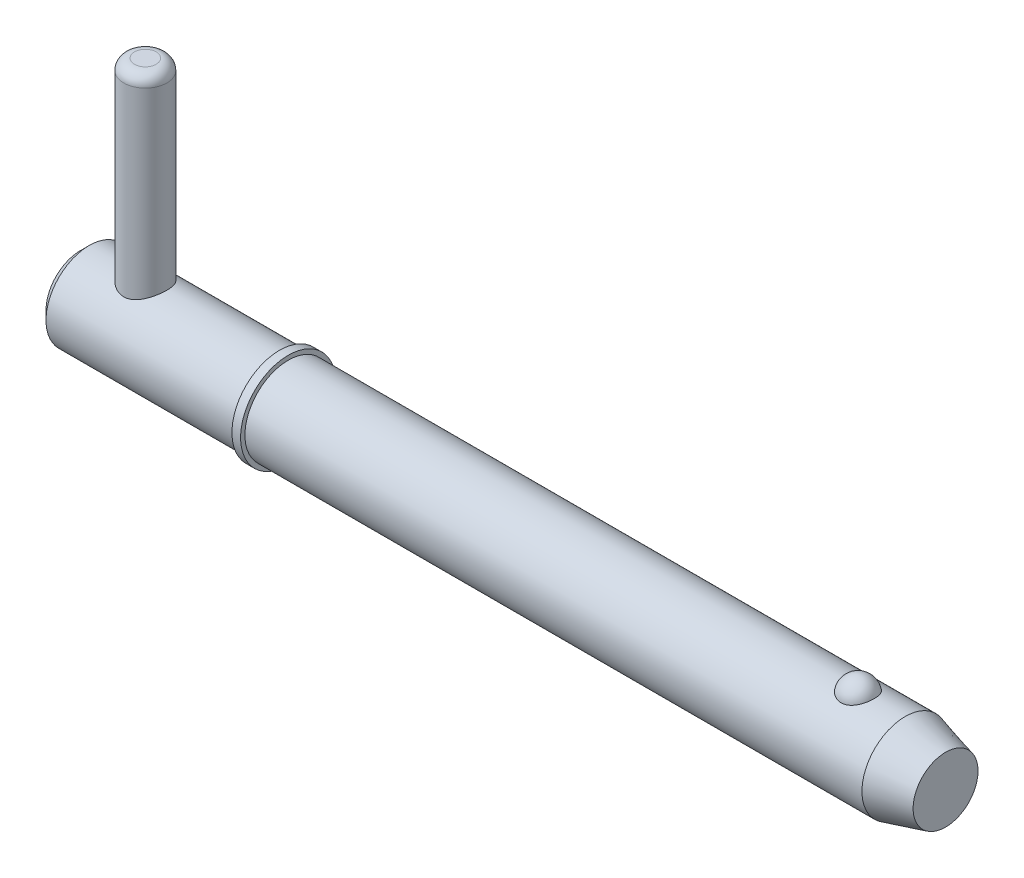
ISO-10303-21;
HEADER;
FILE_DESCRIPTION(('STEP AP214'),'2;1');
FILE_NAME('part.step','',(''),(''),'','','');
FILE_SCHEMA(('AUTOMOTIVE_DESIGN { 1 0 10303 214 1 1 1 1 }'));
ENDSEC;
DATA;
#1=APPLICATION_CONTEXT('core data for automotive mechanical design processes');
#2=APPLICATION_PROTOCOL_DEFINITION('international standard','automotive_design',2000,#1);
#3=PRODUCT_CONTEXT('',#1,'mechanical');
#4=PRODUCT('Part','Part','',(#3));
#5=PRODUCT_RELATED_PRODUCT_CATEGORY('part','',(#4));
#6=PRODUCT_DEFINITION_FORMATION('','',#4);
#7=PRODUCT_DEFINITION_CONTEXT('part definition',#1,'design');
#8=PRODUCT_DEFINITION('design','',#6,#7);
#9=PRODUCT_DEFINITION_SHAPE('','',#8);
#10=(LENGTH_UNIT() NAMED_UNIT(*) SI_UNIT(.MILLI.,.METRE.));
#11=(NAMED_UNIT(*) PLANE_ANGLE_UNIT() SI_UNIT($,.RADIAN.));
#12=(NAMED_UNIT(*) SI_UNIT($,.STERADIAN.) SOLID_ANGLE_UNIT());
#13=UNCERTAINTY_MEASURE_WITH_UNIT(LENGTH_MEASURE(1.E-05),#10,'distance_accuracy_value','');
#14=(GEOMETRIC_REPRESENTATION_CONTEXT(3) GLOBAL_UNCERTAINTY_ASSIGNED_CONTEXT((#13)) GLOBAL_UNIT_ASSIGNED_CONTEXT((#10,
#11,#12)) REPRESENTATION_CONTEXT('',''));
#15=CARTESIAN_POINT('',(0.,0.,0.));
#16=DIRECTION('',(0.,0.,1.));
#17=DIRECTION('',(1.,0.,0.));
#18=AXIS2_PLACEMENT_3D('',#15,#16,#17);
#19=CARTESIAN_POINT('',(5.94,21.43,0.));
#20=DIRECTION('',(0.,-1.,0.));
#21=DIRECTION('',(0.,0.,-1.));
#22=AXIS2_PLACEMENT_3D('',#19,#20,#21);
#23=CYLINDRICAL_SURFACE('',#22,1.98);
#24=CARTESIAN_POINT('',(5.94,-2.98,0.));
#25=DIRECTION('',(0.,1.,0.));
#26=DIRECTION('',(0.,0.,1.));
#27=AXIS2_PLACEMENT_3D('',#24,#25,#26);
#28=CIRCLE('',#27,1.98);
#29=CARTESIAN_POINT('',(5.94,-2.98,1.98));
#30=VERTEX_POINT('',#29);
#31=EDGE_CURVE('P0_E25',#30,#30,#28,.T.);
#32=ORIENTED_EDGE('',*,*,#31,.T.);
#33=EDGE_LOOP('',(#32));
#34=FACE_BOUND('',#33,.T.);
#35=CARTESIAN_POINT('',(5.94,20.44,0.));
#36=DIRECTION('',(0.,1.,0.));
#37=DIRECTION('',(0.,0.,1.));
#38=AXIS2_PLACEMENT_3D('',#35,#36,#37);
#39=CIRCLE('',#38,1.98);
#40=CARTESIAN_POINT('',(5.94,20.44,1.98));
#41=VERTEX_POINT('',#40);
#42=EDGE_CURVE('P0_E29',#41,#41,#39,.F.);
#43=ORIENTED_EDGE('',*,*,#42,.T.);
#44=EDGE_LOOP('',(#43));
#45=FACE_BOUND('',#44,.T.);
#46=ADVANCED_FACE('P0_F14',(#34,#45),#23,.T.);
#47=CARTESIAN_POINT('',(5.94,21.43,0.));
#48=DIRECTION('',(0.,1.,0.));
#49=DIRECTION('',(0.,0.,1.));
#50=AXIS2_PLACEMENT_3D('',#47,#48,#49);
#51=PLANE('',#50);
#52=CARTESIAN_POINT('',(5.94,21.43,0.));
#53=DIRECTION('',(0.,1.,0.));
#54=DIRECTION('',(0.,0.,1.));
#55=AXIS2_PLACEMENT_3D('',#52,#53,#54);
#56=CIRCLE('',#55,0.99);
#57=CARTESIAN_POINT('',(5.94,21.43,0.99));
#58=VERTEX_POINT('',#57);
#59=EDGE_CURVE('P0_E10',#58,#58,#56,.T.);
#60=ORIENTED_EDGE('',*,*,#59,.T.);
#61=EDGE_LOOP('',(#60));
#62=FACE_BOUND('',#61,.T.);
#63=ADVANCED_FACE('P0_F46',(#62),#51,.T.);
#64=CARTESIAN_POINT('',(5.94,-3.97,0.));
#65=DIRECTION('',(0.,1.,0.));
#66=DIRECTION('',(0.,0.,1.));
#67=AXIS2_PLACEMENT_3D('',#64,#65,#66);
#68=PLANE('',#67);
#69=CARTESIAN_POINT('',(5.94,-3.97,0.));
#70=DIRECTION('',(0.,1.,0.));
#71=DIRECTION('',(0.,0.,1.));
#72=AXIS2_PLACEMENT_3D('',#69,#70,#71);
#73=CIRCLE('',#72,0.99);
#74=CARTESIAN_POINT('',(5.94,-3.97,0.99));
#75=VERTEX_POINT('',#74);
#76=EDGE_CURVE('P0_E21',#75,#75,#73,.F.);
#77=ORIENTED_EDGE('',*,*,#76,.T.);
#78=EDGE_LOOP('',(#77));
#79=FACE_BOUND('',#78,.T.);
#80=ADVANCED_FACE('P0_F43',(#79),#68,.F.);
#81=CARTESIAN_POINT('',(5.94,-2.98,0.));
#82=DIRECTION('',(0.,1.,0.));
#83=DIRECTION('',(0.,0.,1.));
#84=AXIS2_PLACEMENT_3D('',#81,#82,#83);
#85=DEGENERATE_TOROIDAL_SURFACE('',#84,0.99,0.99,.T.);
#86=ORIENTED_EDGE('',*,*,#76,.F.);
#87=EDGE_LOOP('',(#86));
#88=FACE_BOUND('',#87,.T.);
#89=ORIENTED_EDGE('',*,*,#31,.F.);
#90=EDGE_LOOP('',(#89));
#91=FACE_BOUND('',#90,.T.);
#92=ADVANCED_FACE('P0_F38',(#88,#91),#85,.T.);
#93=CARTESIAN_POINT('',(5.94,20.44,0.));
#94=DIRECTION('',(0.,1.,0.));
#95=DIRECTION('',(0.,0.,1.));
#96=AXIS2_PLACEMENT_3D('',#93,#94,#95);
#97=DEGENERATE_TOROIDAL_SURFACE('',#96,0.99,0.99,.T.);
#98=ORIENTED_EDGE('',*,*,#42,.F.);
#99=EDGE_LOOP('',(#98));
#100=FACE_BOUND('',#99,.T.);
#101=ORIENTED_EDGE('',*,*,#59,.F.);
#102=EDGE_LOOP('',(#101));
#103=FACE_BOUND('',#102,.T.);
#104=ADVANCED_FACE('P0_F16',(#100,#103),#97,.T.);
#105=CLOSED_SHELL('',(#46,#63,#80,#92,#104));
#106=MANIFOLD_SOLID_BREP('P0_B1',#105);
#107=CARTESIAN_POINT('',(0.,0.,0.));
#108=DIRECTION('',(1.,0.,0.));
#109=DIRECTION('',(0.,0.,-1.));
#110=AXIS2_PLACEMENT_3D('',#107,#108,#109);
#111=CYLINDRICAL_SURFACE('',#110,3.97);
#112=CARTESIAN_POINT('',(75.6759395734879,0.,0.));
#113=DIRECTION('',(1.,0.,0.));
#114=DIRECTION('',(0.,0.,-1.));
#115=AXIS2_PLACEMENT_3D('',#112,#113,#114);
#116=CIRCLE('',#115,3.97);
#117=CARTESIAN_POINT('',(75.6759395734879,0.,-3.97));
#118=VERTEX_POINT('',#117);
#119=EDGE_CURVE('P1_E81',#118,#118,#116,.T.);
#120=ORIENTED_EDGE('',*,*,#119,.F.);
#121=EDGE_LOOP('',(#120));
#122=FACE_BOUND('',#121,.T.);
#123=CARTESIAN_POINT('',(19.05,0.,0.));
#124=DIRECTION('',(1.,0.,0.));
#125=DIRECTION('',(0.,0.,-1.));
#126=AXIS2_PLACEMENT_3D('',#123,#124,#125);
#127=CIRCLE('',#126,3.97);
#128=CARTESIAN_POINT('',(19.05,0.,-3.97));
#129=VERTEX_POINT('',#128);
#130=EDGE_CURVE('P1_E85',#129,#129,#127,.T.);
#131=ORIENTED_EDGE('',*,*,#130,.T.);
#132=EDGE_LOOP('',(#131));
#133=FACE_BOUND('',#132,.T.);
#134=CARTESIAN_POINT('',(71.3451922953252,3.65715365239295,1.54470941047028));
#135=CARTESIAN_POINT('',(71.2652448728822,3.65716001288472,1.54470290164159));
#136=CARTESIAN_POINT('',(71.1851650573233,3.65987074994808,1.53832549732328));
#137=CARTESIAN_POINT('',(71.0272374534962,3.6704221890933,1.51297018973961));
#138=CARTESIAN_POINT('',(70.9493961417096,3.67827646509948,1.49395894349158));
#139=CARTESIAN_POINT('',(70.7984614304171,3.69818848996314,1.44395950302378));
#140=CARTESIAN_POINT('',(70.7253560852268,3.71023513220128,1.41300293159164));
#141=CARTESIAN_POINT('',(70.5855630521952,3.7372183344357,1.34000212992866));
#142=CARTESIAN_POINT('',(70.5188725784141,3.75215363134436,1.29796274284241));
#143=CARTESIAN_POINT('',(70.3914886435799,3.78384968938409,1.20248834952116));
#144=CARTESIAN_POINT('',(70.3310299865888,3.80065129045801,1.14875388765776));
#145=CARTESIAN_POINT('',(70.2196942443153,3.83398532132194,1.03205417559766));
#146=CARTESIAN_POINT('',(70.1688200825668,3.85051766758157,0.969086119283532));
#147=CARTESIAN_POINT('',(70.0756321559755,3.88238608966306,0.832526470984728));
#148=CARTESIAN_POINT('',(70.0337961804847,3.89763698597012,0.75858832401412));
#149=CARTESIAN_POINT('',(69.9625108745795,3.92451063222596,0.60435211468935));
#150=CARTESIAN_POINT('',(69.9330623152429,3.93613315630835,0.524053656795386));
#151=CARTESIAN_POINT('',(69.8868927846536,3.95467606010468,0.358403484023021));
#152=CARTESIAN_POINT('',(69.8703127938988,3.96154426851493,0.273006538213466));
#153=CARTESIAN_POINT('',(69.850756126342,3.96967008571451,0.100408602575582));
#154=CARTESIAN_POINT('',(69.8477789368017,3.97092790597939,0.0132076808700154));
#155=CARTESIAN_POINT('',(69.8554587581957,3.96771794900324,-0.159844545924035));
#156=CARTESIAN_POINT('',(69.8660164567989,3.96329187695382,-0.245701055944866));
#157=CARTESIAN_POINT('',(69.9003800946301,3.94923163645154,-0.414277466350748));
#158=CARTESIAN_POINT('',(69.9241862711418,3.93959737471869,-0.496997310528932));
#159=CARTESIAN_POINT('',(69.9846114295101,3.91607752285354,-0.657113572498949));
#160=CARTESIAN_POINT('',(70.0212495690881,3.90218558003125,-0.734501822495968));
#161=CARTESIAN_POINT('',(70.1065935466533,3.87158287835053,-0.88170483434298));
#162=CARTESIAN_POINT('',(70.1553004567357,3.8548718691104,-0.951518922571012));
#163=CARTESIAN_POINT('',(70.2641161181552,3.82028735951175,-1.08208159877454));
#164=CARTESIAN_POINT('',(70.3242955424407,3.80240713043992,-1.14276958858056));
#165=CARTESIAN_POINT('',(70.454493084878,3.76758161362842,-1.2528243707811));
#166=CARTESIAN_POINT('',(70.5245105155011,3.75063626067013,-1.30219195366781));
#167=CARTESIAN_POINT('',(70.67118160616,3.71998948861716,-1.38729709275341));
#168=CARTESIAN_POINT('',(70.7476813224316,3.70623183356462,-1.42327904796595));
#169=CARTESIAN_POINT('',(70.9062981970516,3.68323188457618,-1.48178996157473));
#170=CARTESIAN_POINT('',(70.9884132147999,3.67398788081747,-1.5043240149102));
#171=CARTESIAN_POINT('',(71.1514810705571,3.6615216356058,-1.53440939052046));
#172=CARTESIAN_POINT('',(71.2322840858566,3.65801951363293,-1.54265826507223));
#173=CARTESIAN_POINT('',(71.3942085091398,3.65657341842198,-1.5460842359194));
#174=CARTESIAN_POINT('',(71.4753298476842,3.65862829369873,-1.54126404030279));
#175=CARTESIAN_POINT('',(71.6328122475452,3.66788969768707,-1.51908474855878));
#176=CARTESIAN_POINT('',(71.7092422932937,3.67492621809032,-1.50213925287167));
#177=CARTESIAN_POINT('',(71.8580412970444,3.69318404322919,-1.45666982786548));
#178=CARTESIAN_POINT('',(71.9304099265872,3.70440568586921,-1.42814496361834));
#179=CARTESIAN_POINT('',(72.0708029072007,3.73012749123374,-1.35956319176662));
#180=CARTESIAN_POINT('',(72.1387000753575,3.74469307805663,-1.31927107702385));
#181=CARTESIAN_POINT('',(72.2668649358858,3.77545272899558,-1.22847440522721));
#182=CARTESIAN_POINT('',(72.3271308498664,3.79164717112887,-1.17796747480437));
#183=CARTESIAN_POINT('',(72.4416346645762,3.82490325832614,-1.06519260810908));
#184=CARTESIAN_POINT('',(72.4954137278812,3.84196735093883,-1.00245914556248));
#185=CARTESIAN_POINT('',(72.5920988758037,3.87439863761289,-0.868715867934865));
#186=CARTESIAN_POINT('',(72.6350030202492,3.88976552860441,-0.797704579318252));
#187=CARTESIAN_POINT('',(72.710266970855,3.91771381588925,-0.646896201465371));
#188=CARTESIAN_POINT('',(72.7422532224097,3.93019255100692,-0.566893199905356));
#189=CARTESIAN_POINT('',(72.7931101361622,3.95043886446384,-0.402255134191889));
#190=CARTESIAN_POINT('',(72.8119807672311,3.95820643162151,-0.31762005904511));
#191=CARTESIAN_POINT('',(72.8362162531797,3.96823733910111,-0.146156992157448));
#192=CARTESIAN_POINT('',(72.8415874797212,3.97050327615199,-0.0593300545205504));
#193=CARTESIAN_POINT('',(72.8387309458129,3.96930811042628,0.114057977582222));
#194=CARTESIAN_POINT('',(72.830503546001,3.9658471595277,0.200619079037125));
#195=CARTESIAN_POINT('',(72.8007063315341,3.95358562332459,0.370506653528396));
#196=CARTESIAN_POINT('',(72.7792129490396,3.94481563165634,0.453848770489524));
#197=CARTESIAN_POINT('',(72.7233839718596,3.92284586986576,0.615497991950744));
#198=CARTESIAN_POINT('',(72.6890474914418,3.90964579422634,0.69380474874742));
#199=CARTESIAN_POINT('',(72.6079702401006,3.88006987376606,0.843703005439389));
#200=CARTESIAN_POINT('',(72.5611536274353,3.86367478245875,0.915249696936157));
#201=CARTESIAN_POINT('',(72.4561897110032,3.82949741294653,1.04910810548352));
#202=CARTESIAN_POINT('',(72.3980428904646,3.81171519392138,1.11142021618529));
#203=CARTESIAN_POINT('',(72.2717433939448,3.77673366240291,1.22503948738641));
#204=CARTESIAN_POINT('',(72.2035970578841,3.75953398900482,1.27635357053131));
#205=CARTESIAN_POINT('',(72.0589009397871,3.72770506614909,1.36653336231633));
#206=CARTESIAN_POINT('',(71.982348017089,3.71307678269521,1.40539439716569));
#207=CARTESIAN_POINT('',(71.8257594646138,3.68864287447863,1.46830480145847));
#208=CARTESIAN_POINT('',(71.7459307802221,3.67869017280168,1.49281289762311));
#209=CARTESIAN_POINT('',(71.5829877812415,3.66414535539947,1.52817474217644));
#210=CARTESIAN_POINT('',(71.4998840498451,3.65953723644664,1.53906926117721));
#211=CARTESIAN_POINT('',(71.3927760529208,3.6573894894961,1.54414878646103));
#212=CARTESIAN_POINT('',(71.3689900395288,3.65715175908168,1.54471134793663));
#213=CARTESIAN_POINT('',(71.3451922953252,3.65715365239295,1.54470941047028));
#214=B_SPLINE_CURVE_WITH_KNOTS('',3,(#134,#135,#136,#137,#138,#139,#140,#141,#142,#143,#144,
#145,#146,#147,#148,#149,#150,#151,#152,#153,#154,#155,#156,#157,#158,#159,#160,#161,#162,#163,
#164,#165,#166,#167,#168,#169,#170,#171,#172,#173,#174,#175,#176,#177,#178,#179,#180,#181,#182,
#183,#184,#185,#186,#187,#188,#189,#190,#191,#192,#193,#194,#195,#196,#197,#198,#199,#200,#201,
#202,#203,#204,#205,#206,#207,#208,#209,#210,#211,#212,#213),.UNSPECIFIED.,.T.,.F.,(4,2,2,2,2,2,
2,2,2,2,2,2,2,2,2,2,2,2,2,2,2,2,2,2,2,2,2,2,2,2,2,2,2,2,2,2,2,2,2,4),(0.,0.239777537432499,
0.480190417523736,0.719971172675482,0.959647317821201,1.20639040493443,1.45320863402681,
1.7109367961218,1.96868099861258,2.22921052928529,2.48973023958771,2.74834928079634,
3.00697295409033,3.26598440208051,3.52501886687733,3.78570385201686,4.04637062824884,
4.30201257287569,4.5575576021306,4.80022994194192,5.04285200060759,5.27757006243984,
5.51230707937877,5.75210128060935,5.99195126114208,6.24392810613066,6.49594987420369,
6.75588818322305,7.01582710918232,7.27564332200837,7.53545264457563,7.79377886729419,
8.0521229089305,8.31207418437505,8.57201437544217,8.83179046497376,9.09166393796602,
9.34270057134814,9.59298357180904,9.66435753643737),.UNSPECIFIED.);
#215=CARTESIAN_POINT('',(71.3451922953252,3.65715365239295,1.54470941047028));
#216=VERTEX_POINT('',#215);
#217=EDGE_CURVE('P1_E35',#216,#216,#214,.T.);
#218=ORIENTED_EDGE('',*,*,#217,.T.);
#219=EDGE_LOOP('',(#218));
#220=FACE_BOUND('',#219,.T.);
#221=ADVANCED_FACE('P1_F13',(#122,#133,#220),#111,.T.);
#222=CARTESIAN_POINT('',(0.,0.,0.));
#223=DIRECTION('',(-1.,0.,0.));
#224=DIRECTION('',(0.,0.,1.));
#225=AXIS2_PLACEMENT_3D('',#222,#223,#224);
#226=PLANE('',#225);
#227=CARTESIAN_POINT('',(0.,0.,0.));
#228=DIRECTION('',(1.,0.,0.));
#229=DIRECTION('',(0.,0.,-1.));
#230=AXIS2_PLACEMENT_3D('',#227,#228,#229);
#231=CIRCLE('',#230,3.176);
#232=CARTESIAN_POINT('',(0.,0.,-3.176));
#233=VERTEX_POINT('',#232);
#234=EDGE_CURVE('P1_E9',#233,#233,#231,.T.);
#235=ORIENTED_EDGE('',*,*,#234,.F.);
#236=EDGE_LOOP('',(#235));
#237=FACE_BOUND('',#236,.T.);
#238=ADVANCED_FACE('P1_F15',(#237),#226,.T.);
#239=CARTESIAN_POINT('',(0.793999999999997,0.,0.));
#240=DIRECTION('',(1.,0.,0.));
#241=DIRECTION('',(0.,0.,-1.));
#242=AXIS2_PLACEMENT_3D('',#239,#240,#241);
#243=CONICAL_SURFACE('',#242,3.97,0.78539816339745);
#244=ORIENTED_EDGE('',*,*,#234,.T.);
#245=EDGE_LOOP('',(#244));
#246=FACE_BOUND('',#245,.T.);
#247=CARTESIAN_POINT('',(0.793999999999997,0.,0.));
#248=DIRECTION('',(1.,0.,0.));
#249=DIRECTION('',(0.,0.,-1.));
#250=AXIS2_PLACEMENT_3D('',#247,#248,#249);
#251=CIRCLE('',#250,3.97);
#252=CARTESIAN_POINT('',(0.793999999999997,0.,-3.97));
#253=VERTEX_POINT('',#252);
#254=EDGE_CURVE('P1_E26',#253,#253,#251,.T.);
#255=ORIENTED_EDGE('',*,*,#254,.F.);
#256=EDGE_LOOP('',(#255));
#257=FACE_BOUND('',#256,.T.);
#258=ADVANCED_FACE('P1_F77',(#246,#257),#243,.T.);
#259=CARTESIAN_POINT('',(0.,0.,0.));
#260=DIRECTION('',(1.,0.,0.));
#261=DIRECTION('',(0.,0.,-1.));
#262=AXIS2_PLACEMENT_3D('',#259,#260,#261);
#263=CYLINDRICAL_SURFACE('',#262,3.97);
#264=CARTESIAN_POINT('',(5.94,-3.44100276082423,1.98));
#265=CARTESIAN_POINT('',(5.8367885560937,-3.44101282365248,1.97999171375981));
#266=CARTESIAN_POINT('',(5.73344176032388,-3.44571749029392,1.97187534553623));
#267=CARTESIAN_POINT('',(5.52991905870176,-3.46385873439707,1.93981946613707));
#268=CARTESIAN_POINT('',(5.42975031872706,-3.47731375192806,1.91584653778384));
#269=CARTESIAN_POINT('',(5.23590869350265,-3.51100678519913,1.85336773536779));
#270=CARTESIAN_POINT('',(5.14220446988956,-3.53120882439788,1.81493880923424));
#271=CARTESIAN_POINT('',(4.9625969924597,-3.57606420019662,1.72487335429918));
#272=CARTESIAN_POINT('',(4.87669412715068,-3.6007177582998,1.67323616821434));
#273=CARTESIAN_POINT('',(4.70734412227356,-3.65417020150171,1.55325205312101));
#274=CARTESIAN_POINT('',(4.62467662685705,-3.68314323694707,1.4838818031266));
#275=CARTESIAN_POINT('',(4.47154355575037,-3.74056406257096,1.33252902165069));
#276=CARTESIAN_POINT('',(4.40108404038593,-3.76901158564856,1.25054026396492));
#277=CARTESIAN_POINT('',(4.26974803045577,-3.82445556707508,1.06956584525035));
#278=CARTESIAN_POINT('',(4.20982960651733,-3.8512271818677,0.969809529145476));
#279=CARTESIAN_POINT('',(4.10798077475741,-3.89804342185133,0.760047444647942));
#280=CARTESIAN_POINT('',(4.06603907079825,-3.91809226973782,0.650048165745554));
#281=CARTESIAN_POINT('',(4.00441878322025,-3.94794912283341,0.431181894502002));
#282=CARTESIAN_POINT('',(3.98337329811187,-3.95838209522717,0.322786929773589));
#283=CARTESIAN_POINT('',(3.9596425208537,-3.97016407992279,0.103541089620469));
#284=CARTESIAN_POINT('',(3.95694618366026,-3.97151855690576,-0.00730826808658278));
#285=CARTESIAN_POINT('',(3.9694599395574,-3.96528826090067,-0.218044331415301));
#286=CARTESIAN_POINT('',(3.98314071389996,-3.95846689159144,-0.318049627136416));
#287=CARTESIAN_POINT('',(4.02528522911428,-3.93780347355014,-0.514124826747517));
#288=CARTESIAN_POINT('',(4.05375007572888,-3.92396089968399,-0.61019443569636));
#289=CARTESIAN_POINT('',(4.12484256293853,-3.89028355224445,-0.797351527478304));
#290=CARTESIAN_POINT('',(4.16766142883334,-3.87036821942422,-0.888351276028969));
#291=CARTESIAN_POINT('',(4.26598377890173,-3.82634285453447,-1.06209448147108));
#292=CARTESIAN_POINT('',(4.32149181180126,-3.8022313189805,-1.14483496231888));
#293=CARTESIAN_POINT('',(4.44962332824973,-3.74940011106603,-1.30802500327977));
#294=CARTESIAN_POINT('',(4.52336636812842,-3.72046031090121,-1.38752498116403));
#295=CARTESIAN_POINT('',(4.68287656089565,-3.66269463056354,-1.53354043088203));
#296=CARTESIAN_POINT('',(4.7686527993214,-3.63386885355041,-1.60004599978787));
#297=CARTESIAN_POINT('',(4.9564069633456,-3.57763161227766,-1.72228426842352));
#298=CARTESIAN_POINT('',(5.05906485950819,-3.5504233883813,-1.77707534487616));
#299=CARTESIAN_POINT('',(5.27381412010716,-3.50334038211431,-1.86819784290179));
#300=CARTESIAN_POINT('',(5.38589553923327,-3.48345798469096,-1.90454844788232));
#301=CARTESIAN_POINT('',(5.6069795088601,-3.45548331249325,-1.95481643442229));
#302=CARTESIAN_POINT('',(5.71552407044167,-3.44658268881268,-1.97028113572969));
#303=CARTESIAN_POINT('',(5.93399639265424,-3.43928114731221,-1.98300600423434));
#304=CARTESIAN_POINT('',(6.04392313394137,-3.44087289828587,-1.98027888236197));
#305=CARTESIAN_POINT('',(6.24931618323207,-3.45351901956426,-1.95811780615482));
#306=CARTESIAN_POINT('',(6.34505668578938,-3.46352725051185,-1.94052989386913));
#307=CARTESIAN_POINT('',(6.53204702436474,-3.49033612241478,-1.89188242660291));
#308=CARTESIAN_POINT('',(6.62329540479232,-3.50713894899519,-1.86081853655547));
#309=CARTESIAN_POINT('',(6.80352105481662,-3.54655680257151,-1.78458666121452));
#310=CARTESIAN_POINT('',(6.89219712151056,-3.56940508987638,-1.73883178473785));
#311=CARTESIAN_POINT('',(7.06112449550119,-3.61813012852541,-1.63502913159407));
#312=CARTESIAN_POINT('',(7.14137144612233,-3.6440084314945,-1.57697504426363));
#313=CARTESIAN_POINT('',(7.30168083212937,-3.69977514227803,-1.44171920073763));
#314=CARTESIAN_POINT('',(7.38046039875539,-3.7297597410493,-1.36302972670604));
#315=CARTESIAN_POINT('',(7.52409649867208,-3.78754991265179,-1.19307190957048));
#316=CARTESIAN_POINT('',(7.58894840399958,-3.81535475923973,-1.10179940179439));
#317=CARTESIAN_POINT('',(7.70430122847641,-3.86658972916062,-0.906019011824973));
#318=CARTESIAN_POINT('',(7.75438714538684,-3.88988795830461,-0.801229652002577));
#319=CARTESIAN_POINT('',(7.83572184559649,-3.92848199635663,-0.583216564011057));
#320=CARTESIAN_POINT('',(7.86698708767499,-3.94378479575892,-0.470000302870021));
#321=CARTESIAN_POINT('',(7.90711051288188,-3.96355307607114,-0.249525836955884));
#322=CARTESIAN_POINT('',(7.91775648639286,-3.96888171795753,-0.142669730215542));
#323=CARTESIAN_POINT('',(7.92160247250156,-3.97079858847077,0.0714191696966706));
#324=CARTESIAN_POINT('',(7.91480852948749,-3.96738984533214,0.178651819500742));
#325=CARTESIAN_POINT('',(7.88515479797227,-3.9527181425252,0.383072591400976));
#326=CARTESIAN_POINT('',(7.8633739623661,-3.94198303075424,0.480459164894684));
#327=CARTESIAN_POINT('',(7.80581513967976,-3.91422178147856,0.670038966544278));
#328=CARTESIAN_POINT('',(7.77003513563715,-3.89719473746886,0.762231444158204));
#329=CARTESIAN_POINT('',(7.68389191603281,-3.85747818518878,0.943248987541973));
#330=CARTESIAN_POINT('',(7.63296879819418,-3.83457704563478,1.03175978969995));
#331=CARTESIAN_POINT('',(7.51869140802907,-3.7855122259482,1.19934744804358));
#332=CARTESIAN_POINT('',(7.45533142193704,-3.75934704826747,1.2784199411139));
#333=CARTESIAN_POINT('',(7.31068939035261,-3.70329841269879,1.433144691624));
#334=CARTESIAN_POINT('',(7.22825362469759,-3.67330340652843,1.50768183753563));
#335=CARTESIAN_POINT('',(7.05162367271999,-3.61514025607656,1.64226879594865));
#336=CARTESIAN_POINT('',(6.95741928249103,-3.58697372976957,1.70230590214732));
#337=CARTESIAN_POINT('',(6.75590859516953,-3.53504049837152,1.80775364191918));
#338=CARTESIAN_POINT('',(6.64828786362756,-3.51143624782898,1.85265616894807));
#339=CARTESIAN_POINT('',(6.48137774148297,-3.48289659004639,1.90544537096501));
#340=CARTESIAN_POINT('',(6.42488151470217,-3.4745323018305,1.9206071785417));
#341=CARTESIAN_POINT('',(6.31046920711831,-3.4604244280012,1.94591259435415));
#342=CARTESIAN_POINT('',(6.25255415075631,-3.45467900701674,1.95605971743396));
#343=CARTESIAN_POINT('',(6.1521444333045,-3.44728060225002,1.96905939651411));
#344=CARTESIAN_POINT('',(6.10985721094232,-3.44493297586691,1.97315742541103));
#345=CARTESIAN_POINT('',(6.02505433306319,-3.44179192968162,1.97862952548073));
#346=CARTESIAN_POINT('',(5.98253866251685,-3.44099861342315,1.98000341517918));
#347=CARTESIAN_POINT('',(5.94,-3.44100276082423,1.98));
#348=B_SPLINE_CURVE_WITH_KNOTS('',3,(#264,#265,#266,#267,#268,#269,#270,#271,#272,#273,#274,
#275,#276,#277,#278,#279,#280,#281,#282,#283,#284,#285,#286,#287,#288,#289,#290,#291,#292,#293,
#294,#295,#296,#297,#298,#299,#300,#301,#302,#303,#304,#305,#306,#307,#308,#309,#310,#311,#312,
#313,#314,#315,#316,#317,#318,#319,#320,#321,#322,#323,#324,#325,#326,#327,#328,#329,#330,#331,
#332,#333,#334,#335,#336,#337,#338,#339,#340,#341,#342,#343,#344,#345,#346,#347),.UNSPECIFIED.,
.T.,.F.,(4,2,2,2,2,2,2,2,2,2,2,2,2,2,2,2,2,2,2,2,2,2,2,2,2,2,2,2,2,2,2,2,2,2,2,2,2,2,2,2,2,4),
(0.,0.309462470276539,0.619579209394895,0.928068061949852,1.23657226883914,1.57038619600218,
1.90436536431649,2.26071614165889,2.61684266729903,2.94773555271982,3.27842924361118,
3.58050679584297,3.88260694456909,4.18890317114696,4.49530936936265,4.83057163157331,
5.1660884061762,5.52272472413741,5.87898927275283,6.20706708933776,6.53491569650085,
6.82716910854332,7.11951660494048,7.42541184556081,7.73146442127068,8.07586334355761,
8.42037652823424,8.77380887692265,9.12693169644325,9.44775848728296,9.76847409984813,
10.0682302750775,10.3680296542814,10.6806938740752,10.9935020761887,11.3373031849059,
11.6814044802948,12.0361164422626,12.2131519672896,12.3900632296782,12.5175998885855,
12.6451450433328),.UNSPECIFIED.);
#349=CARTESIAN_POINT('',(5.94,-3.44100276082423,1.98));
#350=VERTEX_POINT('',#349);
#351=EDGE_CURVE('P1_E17',#350,#350,#348,.T.);
#352=ORIENTED_EDGE('',*,*,#351,.F.);
#353=EDGE_LOOP('',(#352));
#354=FACE_BOUND('',#353,.T.);
#355=CARTESIAN_POINT('',(5.94,3.44100276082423,1.98));
#356=CARTESIAN_POINT('',(6.0432114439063,3.44101282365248,1.97999171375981));
#357=CARTESIAN_POINT('',(6.14655823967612,3.44571749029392,1.97187534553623));
#358=CARTESIAN_POINT('',(6.35008094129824,3.46385873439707,1.93981946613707));
#359=CARTESIAN_POINT('',(6.45024968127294,3.47731375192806,1.91584653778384));
#360=CARTESIAN_POINT('',(6.64409130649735,3.51100678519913,1.85336773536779));
#361=CARTESIAN_POINT('',(6.73779553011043,3.53120882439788,1.81493880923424));
#362=CARTESIAN_POINT('',(6.91740300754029,3.57606420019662,1.72487335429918));
#363=CARTESIAN_POINT('',(7.00330587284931,3.6007177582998,1.67323616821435));
#364=CARTESIAN_POINT('',(7.17265587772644,3.65417020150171,1.55325205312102));
#365=CARTESIAN_POINT('',(7.25532337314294,3.68314323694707,1.4838818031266));
#366=CARTESIAN_POINT('',(7.40845644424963,3.74056406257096,1.3325290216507));
#367=CARTESIAN_POINT('',(7.47891595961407,3.76901158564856,1.25054026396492));
#368=CARTESIAN_POINT('',(7.61025196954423,3.82445556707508,1.06956584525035));
#369=CARTESIAN_POINT('',(7.67017039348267,3.8512271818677,0.969809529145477));
#370=CARTESIAN_POINT('',(7.77201922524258,3.89804342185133,0.760047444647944));
#371=CARTESIAN_POINT('',(7.81396092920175,3.91809226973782,0.650048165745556));
#372=CARTESIAN_POINT('',(7.87558121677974,3.94794912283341,0.431181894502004));
#373=CARTESIAN_POINT('',(7.89662670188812,3.95838209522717,0.322786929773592));
#374=CARTESIAN_POINT('',(7.9203574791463,3.97016407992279,0.103541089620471));
#375=CARTESIAN_POINT('',(7.92305381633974,3.97151855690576,-0.00730826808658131));
#376=CARTESIAN_POINT('',(7.9105400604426,3.96528826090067,-0.2180443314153));
#377=CARTESIAN_POINT('',(7.89685928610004,3.95846689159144,-0.318049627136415));
#378=CARTESIAN_POINT('',(7.85471477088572,3.93780347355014,-0.514124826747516));
#379=CARTESIAN_POINT('',(7.82624992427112,3.92396089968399,-0.61019443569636));
#380=CARTESIAN_POINT('',(7.75515743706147,3.89028355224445,-0.797351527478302));
#381=CARTESIAN_POINT('',(7.71233857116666,3.87036821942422,-0.888351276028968));
#382=CARTESIAN_POINT('',(7.61401622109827,3.82634285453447,-1.06209448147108));
#383=CARTESIAN_POINT('',(7.55850818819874,3.8022313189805,-1.14483496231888));
#384=CARTESIAN_POINT('',(7.43037667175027,3.74940011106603,-1.30802500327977));
#385=CARTESIAN_POINT('',(7.35663363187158,3.72046031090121,-1.38752498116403));
#386=CARTESIAN_POINT('',(7.19712343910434,3.66269463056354,-1.53354043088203));
#387=CARTESIAN_POINT('',(7.1113472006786,3.63386885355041,-1.60004599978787));
#388=CARTESIAN_POINT('',(6.9235930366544,3.57763161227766,-1.72228426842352));
#389=CARTESIAN_POINT('',(6.82093514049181,3.5504233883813,-1.77707534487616));
#390=CARTESIAN_POINT('',(6.60618587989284,3.50334038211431,-1.86819784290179));
#391=CARTESIAN_POINT('',(6.49410446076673,3.48345798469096,-1.90454844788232));
#392=CARTESIAN_POINT('',(6.2730204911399,3.45548331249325,-1.95481643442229));
#393=CARTESIAN_POINT('',(6.16447592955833,3.44658268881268,-1.97028113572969));
#394=CARTESIAN_POINT('',(5.94600360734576,3.43928114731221,-1.98300600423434));
#395=CARTESIAN_POINT('',(5.83607686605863,3.44087289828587,-1.98027888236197));
#396=CARTESIAN_POINT('',(5.63068381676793,3.45351901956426,-1.95811780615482));
#397=CARTESIAN_POINT('',(5.53494331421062,3.46352725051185,-1.94052989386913));
#398=CARTESIAN_POINT('',(5.34795297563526,3.49033612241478,-1.89188242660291));
#399=CARTESIAN_POINT('',(5.25670459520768,3.50713894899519,-1.86081853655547));
#400=CARTESIAN_POINT('',(5.07647894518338,3.54655680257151,-1.78458666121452));
#401=CARTESIAN_POINT('',(4.98780287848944,3.56940508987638,-1.73883178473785));
#402=CARTESIAN_POINT('',(4.81887550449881,3.61813012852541,-1.63502913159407));
#403=CARTESIAN_POINT('',(4.73862855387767,3.6440084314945,-1.57697504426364));
#404=CARTESIAN_POINT('',(4.57831916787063,3.69977514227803,-1.44171920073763));
#405=CARTESIAN_POINT('',(4.49953960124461,3.7297597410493,-1.36302972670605));
#406=CARTESIAN_POINT('',(4.35590350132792,3.78754991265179,-1.19307190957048));
#407=CARTESIAN_POINT('',(4.29105159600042,3.81535475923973,-1.10179940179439));
#408=CARTESIAN_POINT('',(4.17569877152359,3.86658972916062,-0.906019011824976));
#409=CARTESIAN_POINT('',(4.12561285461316,3.88988795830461,-0.80122965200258));
#410=CARTESIAN_POINT('',(4.04427815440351,3.92848199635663,-0.58321656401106));
#411=CARTESIAN_POINT('',(4.01301291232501,3.94378479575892,-0.470000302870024));
#412=CARTESIAN_POINT('',(3.97288948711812,3.96355307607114,-0.249525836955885));
#413=CARTESIAN_POINT('',(3.96224351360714,3.96888171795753,-0.142669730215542));
#414=CARTESIAN_POINT('',(3.95839752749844,3.97079858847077,0.0714191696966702));
#415=CARTESIAN_POINT('',(3.96519147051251,3.96738984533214,0.178651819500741));
#416=CARTESIAN_POINT('',(3.99484520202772,3.9527181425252,0.383072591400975));
#417=CARTESIAN_POINT('',(4.01662603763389,3.94198303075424,0.480459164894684));
#418=CARTESIAN_POINT('',(4.07418486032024,3.91422178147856,0.670038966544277));
#419=CARTESIAN_POINT('',(4.10996486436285,3.89719473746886,0.762231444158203));
#420=CARTESIAN_POINT('',(4.19610808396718,3.85747818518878,0.943248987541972));
#421=CARTESIAN_POINT('',(4.24703120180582,3.83457704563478,1.03175978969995));
#422=CARTESIAN_POINT('',(4.36130859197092,3.7855122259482,1.19934744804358));
#423=CARTESIAN_POINT('',(4.42466857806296,3.75934704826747,1.2784199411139));
#424=CARTESIAN_POINT('',(4.56931060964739,3.70329841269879,1.433144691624));
#425=CARTESIAN_POINT('',(4.65174637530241,3.67330340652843,1.50768183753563));
#426=CARTESIAN_POINT('',(4.82837632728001,3.61514025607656,1.64226879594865));
#427=CARTESIAN_POINT('',(4.92258071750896,3.58697372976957,1.70230590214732));
#428=CARTESIAN_POINT('',(5.12409140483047,3.53504049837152,1.80775364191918));
#429=CARTESIAN_POINT('',(5.23171213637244,3.51143624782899,1.85265616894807));
#430=CARTESIAN_POINT('',(5.39862225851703,3.48289659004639,1.90544537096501));
#431=CARTESIAN_POINT('',(5.45511848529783,3.4745323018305,1.9206071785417));
#432=CARTESIAN_POINT('',(5.56953079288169,3.4604244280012,1.94591259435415));
#433=CARTESIAN_POINT('',(5.62744584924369,3.45467900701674,1.95605971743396));
#434=CARTESIAN_POINT('',(5.7278555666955,3.44728060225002,1.9690593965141));
#435=CARTESIAN_POINT('',(5.77014278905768,3.44493297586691,1.97315742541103));
#436=CARTESIAN_POINT('',(5.85494566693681,3.44179192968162,1.97862952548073));
#437=CARTESIAN_POINT('',(5.89746133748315,3.44099861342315,1.98000341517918));
#438=CARTESIAN_POINT('',(5.94,3.44100276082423,1.98));
#439=B_SPLINE_CURVE_WITH_KNOTS('',3,(#355,#356,#357,#358,#359,#360,#361,#362,#363,#364,#365,
#366,#367,#368,#369,#370,#371,#372,#373,#374,#375,#376,#377,#378,#379,#380,#381,#382,#383,#384,
#385,#386,#387,#388,#389,#390,#391,#392,#393,#394,#395,#396,#397,#398,#399,#400,#401,#402,#403,
#404,#405,#406,#407,#408,#409,#410,#411,#412,#413,#414,#415,#416,#417,#418,#419,#420,#421,#422,
#423,#424,#425,#426,#427,#428,#429,#430,#431,#432,#433,#434,#435,#436,#437,#438),.UNSPECIFIED.,
.T.,.F.,(4,2,2,2,2,2,2,2,2,2,2,2,2,2,2,2,2,2,2,2,2,2,2,2,2,2,2,2,2,2,2,2,2,2,2,2,2,2,2,2,2,4),
(0.,0.309462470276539,0.619579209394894,0.928068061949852,1.23657226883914,1.57038619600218,
1.90436536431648,2.26071614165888,2.61684266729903,2.94773555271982,3.27842924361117,
3.58050679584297,3.88260694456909,4.18890317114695,4.49530936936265,4.83057163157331,
5.1660884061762,5.5227247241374,5.87898927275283,6.20706708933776,6.53491569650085,
6.82716910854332,7.11951660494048,7.42541184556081,7.73146442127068,8.07586334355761,
8.42037652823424,8.77380887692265,9.12693169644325,9.44775848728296,9.76847409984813,
10.0682302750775,10.3680296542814,10.6806938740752,10.9935020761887,11.3373031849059,
11.6814044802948,12.0361164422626,12.2131519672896,12.3900632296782,12.5175998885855,
12.6451450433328),.UNSPECIFIED.);
#440=CARTESIAN_POINT('',(5.94,3.44100276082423,1.98));
#441=VERTEX_POINT('',#440);
#442=EDGE_CURVE('P1_E43',#441,#441,#439,.T.);
#443=ORIENTED_EDGE('',*,*,#442,.F.);
#444=EDGE_LOOP('',(#443));
#445=FACE_BOUND('',#444,.T.);
#446=ORIENTED_EDGE('',*,*,#254,.T.);
#447=EDGE_LOOP('',(#446));
#448=FACE_BOUND('',#447,.T.);
#449=CARTESIAN_POINT('',(18.256,0.,0.));
#450=DIRECTION('',(1.,0.,0.));
#451=DIRECTION('',(0.,0.,-1.));
#452=AXIS2_PLACEMENT_3D('',#449,#450,#451);
#453=CIRCLE('',#452,3.97);
#454=CARTESIAN_POINT('',(18.256,0.,-3.97));
#455=VERTEX_POINT('',#454);
#456=EDGE_CURVE('P1_E31',#455,#455,#453,.T.);
#457=ORIENTED_EDGE('',*,*,#456,.F.);
#458=EDGE_LOOP('',(#457));
#459=FACE_BOUND('',#458,.T.);
#460=ADVANCED_FACE('P1_F103',(#354,#445,#448,#459),#263,.T.);
#461=CARTESIAN_POINT('',(18.256,3.97,0.));
#462=DIRECTION('',(-1.,0.,0.));
#463=DIRECTION('',(0.,0.,1.));
#464=AXIS2_PLACEMENT_3D('',#461,#462,#463);
#465=PLANE('',#464);
#466=ORIENTED_EDGE('',*,*,#456,.T.);
#467=EDGE_LOOP('',(#466));
#468=FACE_BOUND('',#467,.T.);
#469=CARTESIAN_POINT('',(18.256,0.,0.));
#470=DIRECTION('',(1.,0.,0.));
#471=DIRECTION('',(0.,0.,-1.));
#472=AXIS2_PLACEMENT_3D('',#469,#470,#471);
#473=CIRCLE('',#472,4.367);
#474=CARTESIAN_POINT('',(18.256,0.,-4.367));
#475=VERTEX_POINT('',#474);
#476=EDGE_CURVE('P1_E91',#475,#475,#473,.T.);
#477=ORIENTED_EDGE('',*,*,#476,.F.);
#478=EDGE_LOOP('',(#477));
#479=FACE_BOUND('',#478,.T.);
#480=ADVANCED_FACE('P1_F100',(#468,#479),#465,.T.);
#481=CARTESIAN_POINT('',(0.,0.,0.));
#482=DIRECTION('',(1.,0.,0.));
#483=DIRECTION('',(0.,0.,-1.));
#484=AXIS2_PLACEMENT_3D('',#481,#482,#483);
#485=CYLINDRICAL_SURFACE('',#484,4.367);
#486=ORIENTED_EDGE('',*,*,#476,.T.);
#487=EDGE_LOOP('',(#486));
#488=FACE_BOUND('',#487,.T.);
#489=CARTESIAN_POINT('',(19.05,0.,0.));
#490=DIRECTION('',(1.,0.,0.));
#491=DIRECTION('',(0.,0.,-1.));
#492=AXIS2_PLACEMENT_3D('',#489,#490,#491);
#493=CIRCLE('',#492,4.367);
#494=CARTESIAN_POINT('',(19.05,0.,-4.367));
#495=VERTEX_POINT('',#494);
#496=EDGE_CURVE('P1_E88',#495,#495,#493,.T.);
#497=ORIENTED_EDGE('',*,*,#496,.F.);
#498=EDGE_LOOP('',(#497));
#499=FACE_BOUND('',#498,.T.);
#500=ADVANCED_FACE('P1_F68',(#488,#499),#485,.T.);
#501=CARTESIAN_POINT('',(19.05,4.367,0.));
#502=DIRECTION('',(1.,0.,0.));
#503=DIRECTION('',(0.,0.,-1.));
#504=AXIS2_PLACEMENT_3D('',#501,#502,#503);
#505=PLANE('',#504);
#506=ORIENTED_EDGE('',*,*,#496,.T.);
#507=EDGE_LOOP('',(#506));
#508=FACE_BOUND('',#507,.T.);
#509=ORIENTED_EDGE('',*,*,#130,.F.);
#510=EDGE_LOOP('',(#509));
#511=FACE_BOUND('',#510,.T.);
#512=ADVANCED_FACE('P1_F62',(#508,#511),#505,.T.);
#513=CARTESIAN_POINT('',(79.38,0.,0.));
#514=DIRECTION('',(-1.,0.,0.));
#515=DIRECTION('',(0.,0.,1.));
#516=AXIS2_PLACEMENT_3D('',#513,#514,#515);
#517=CONICAL_SURFACE('',#516,2.97750000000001,0.261799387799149);
#518=ORIENTED_EDGE('',*,*,#119,.T.);
#519=EDGE_LOOP('',(#518));
#520=FACE_BOUND('',#519,.T.);
#521=CARTESIAN_POINT('',(79.38,0.,0.));
#522=DIRECTION('',(1.,0.,0.));
#523=DIRECTION('',(0.,0.,-1.));
#524=AXIS2_PLACEMENT_3D('',#521,#522,#523);
#525=CIRCLE('',#524,2.97750000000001);
#526=CARTESIAN_POINT('',(79.38,0.,-2.97750000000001));
#527=VERTEX_POINT('',#526);
#528=EDGE_CURVE('P1_E42',#527,#527,#525,.T.);
#529=ORIENTED_EDGE('',*,*,#528,.F.);
#530=EDGE_LOOP('',(#529));
#531=FACE_BOUND('',#530,.T.);
#532=ADVANCED_FACE('P1_F59',(#520,#531),#517,.T.);
#533=CARTESIAN_POINT('',(79.38,2.97750000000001,0.));
#534=DIRECTION('',(1.,0.,0.));
#535=DIRECTION('',(0.,0.,-1.));
#536=AXIS2_PLACEMENT_3D('',#533,#534,#535);
#537=PLANE('',#536);
#538=ORIENTED_EDGE('',*,*,#528,.T.);
#539=EDGE_LOOP('',(#538));
#540=FACE_BOUND('',#539,.T.);
#541=ADVANCED_FACE('P1_F55',(#540),#537,.T.);
#542=CARTESIAN_POINT('',(71.3451922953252,3.573,0.));
#543=DIRECTION('',(-1.,0.,0.));
#544=DIRECTION('',(0.,1.,0.));
#545=AXIS2_PLACEMENT_3D('',#542,#543,#544);
#546=SPHERICAL_SURFACE('',#545,1.54699999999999);
#547=ORIENTED_EDGE('',*,*,#217,.F.);
#548=EDGE_LOOP('',(#547));
#549=FACE_BOUND('',#548,.T.);
#550=ADVANCED_FACE('P1_F50',(#549),#546,.T.);
#551=CARTESIAN_POINT('',(5.94,-4.367,0.));
#552=DIRECTION('',(0.,1.,0.));
#553=DIRECTION('',(0.,0.,1.));
#554=AXIS2_PLACEMENT_3D('',#551,#552,#553);
#555=CYLINDRICAL_SURFACE('',#554,1.98);
#556=ORIENTED_EDGE('',*,*,#351,.T.);
#557=EDGE_LOOP('',(#556));
#558=FACE_BOUND('',#557,.T.);
#559=ORIENTED_EDGE('',*,*,#442,.T.);
#560=EDGE_LOOP('',(#559));
#561=FACE_BOUND('',#560,.T.);
#562=ADVANCED_FACE('P1_F54',(#558,#561),#555,.F.);
#563=CLOSED_SHELL('',(#221,#238,#258,#460,#480,#500,#512,#532,#541,#550,#562));
#564=MANIFOLD_SOLID_BREP('P1_B1',#563);
#565=ADVANCED_BREP_SHAPE_REPRESENTATION('',(#18,#106,#564),#14);
#566=SHAPE_DEFINITION_REPRESENTATION(#9,#565);
ENDSEC;
END-ISO-10303-21;
